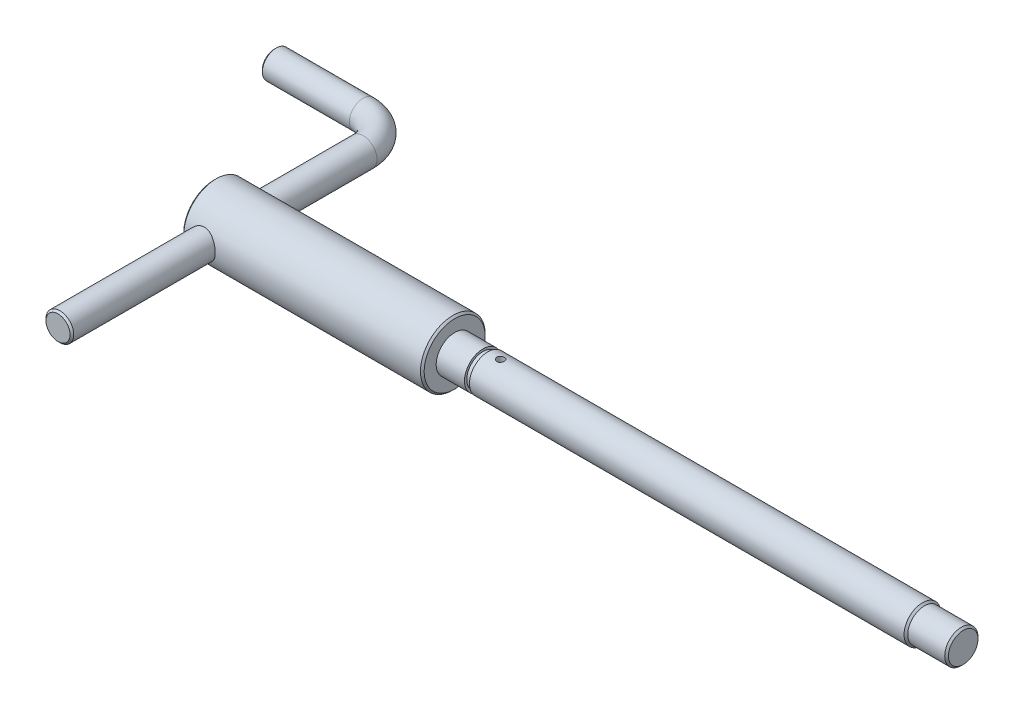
ISO-10303-21;
HEADER;
FILE_DESCRIPTION(('STEP AP214'),'2;1');
FILE_NAME('part.step','',(''),(''),'','','');
FILE_SCHEMA(('AUTOMOTIVE_DESIGN { 1 0 10303 214 1 1 1 1 }'));
ENDSEC;
DATA;
#1=APPLICATION_CONTEXT('core data for automotive mechanical design processes');
#2=APPLICATION_PROTOCOL_DEFINITION('international standard','automotive_design',2000,#1);
#3=PRODUCT_CONTEXT('',#1,'mechanical');
#4=PRODUCT('Part','Part','',(#3));
#5=PRODUCT_RELATED_PRODUCT_CATEGORY('part','',(#4));
#6=PRODUCT_DEFINITION_FORMATION('','',#4);
#7=PRODUCT_DEFINITION_CONTEXT('part definition',#1,'design');
#8=PRODUCT_DEFINITION('design','',#6,#7);
#9=PRODUCT_DEFINITION_SHAPE('','',#8);
#10=(LENGTH_UNIT() NAMED_UNIT(*) SI_UNIT(.MILLI.,.METRE.));
#11=(NAMED_UNIT(*) PLANE_ANGLE_UNIT() SI_UNIT($,.RADIAN.));
#12=(NAMED_UNIT(*) SI_UNIT($,.STERADIAN.) SOLID_ANGLE_UNIT());
#13=UNCERTAINTY_MEASURE_WITH_UNIT(LENGTH_MEASURE(1.E-05),#10,'distance_accuracy_value','');
#14=(GEOMETRIC_REPRESENTATION_CONTEXT(3) GLOBAL_UNCERTAINTY_ASSIGNED_CONTEXT((#13)) GLOBAL_UNIT_ASSIGNED_CONTEXT((#10,
#11,#12)) REPRESENTATION_CONTEXT('',''));
#15=CARTESIAN_POINT('',(0.,0.,0.));
#16=DIRECTION('',(0.,0.,1.));
#17=DIRECTION('',(1.,0.,0.));
#18=AXIS2_PLACEMENT_3D('',#15,#16,#17);
#19=CARTESIAN_POINT('',(0.,0.,0.));
#20=DIRECTION('',(-1.,0.,0.));
#21=DIRECTION('',(0.,0.,1.));
#22=AXIS2_PLACEMENT_3D('',#19,#20,#21);
#23=CYLINDRICAL_SURFACE('',#22,10.);
#24=CARTESIAN_POINT('',(383.,0.,0.));
#25=DIRECTION('',(1.,0.,0.));
#26=DIRECTION('',(0.,0.,-1.));
#27=AXIS2_PLACEMENT_3D('',#24,#25,#26);
#28=CIRCLE('',#27,10.);
#29=CARTESIAN_POINT('',(383.,0.,-10.));
#30=VERTEX_POINT('',#29);
#31=EDGE_CURVE('E74',#30,#30,#28,.F.);
#32=ORIENTED_EDGE('',*,*,#31,.T.);
#33=EDGE_LOOP('',(#32));
#34=FACE_BOUND('',#33,.T.);
#35=CARTESIAN_POINT('',(148.,0.,0.));
#36=DIRECTION('',(-1.,0.,0.));
#37=DIRECTION('',(0.,0.,1.));
#38=AXIS2_PLACEMENT_3D('',#35,#36,#37);
#39=CIRCLE('',#38,10.);
#40=CARTESIAN_POINT('',(148.,0.,10.));
#41=VERTEX_POINT('',#40);
#42=EDGE_CURVE('E153',#41,#41,#39,.T.);
#43=ORIENTED_EDGE('',*,*,#42,.F.);
#44=EDGE_LOOP('',(#43));
#45=FACE_BOUND('',#44,.T.);
#46=CARTESIAN_POINT('',(154.91,-9.79795897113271,-2.));
#47=CARTESIAN_POINT('',(154.798871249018,-9.79796118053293,-1.99999589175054));
#48=CARTESIAN_POINT('',(154.687690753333,-9.79987016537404,-1.99070634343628));
#49=CARTESIAN_POINT('',(154.468474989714,-9.80728862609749,-1.95382456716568));
#50=CARTESIAN_POINT('',(154.360442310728,-9.81280098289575,-1.92621769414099));
#51=CARTESIAN_POINT('',(154.150725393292,-9.82677747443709,-1.85359156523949));
#52=CARTESIAN_POINT('',(154.049034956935,-9.83523867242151,-1.80858962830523));
#53=CARTESIAN_POINT('',(153.854650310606,-9.85415598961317,-1.702498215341));
#54=CARTESIAN_POINT('',(153.761955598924,-9.86461199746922,-1.64140963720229));
#55=CARTESIAN_POINT('',(153.586877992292,-9.88650599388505,-1.50395815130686));
#56=CARTESIAN_POINT('',(153.504640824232,-9.89795475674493,-1.42741131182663));
#57=CARTESIAN_POINT('',(153.354084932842,-9.92044944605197,-1.26161357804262));
#58=CARTESIAN_POINT('',(153.285767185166,-9.93149534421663,-1.17236179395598));
#59=CARTESIAN_POINT('',(153.164423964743,-9.95205592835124,-0.982722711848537));
#60=CARTESIAN_POINT('',(153.111536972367,-9.96155642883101,-0.882245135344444));
#61=CARTESIAN_POINT('',(153.023450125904,-9.97783473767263,-0.673608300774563));
#62=CARTESIAN_POINT('',(152.988248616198,-9.98461280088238,-0.565449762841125));
#63=CARTESIAN_POINT('',(152.936985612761,-9.99460641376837,-0.346033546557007));
#64=CARTESIAN_POINT('',(152.920678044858,-9.99786772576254,-0.234835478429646));
#65=CARTESIAN_POINT('',(152.906898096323,-10.0006184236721,-0.0112371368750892));
#66=CARTESIAN_POINT('',(152.909423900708,-10.0001081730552,0.101163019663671));
#67=CARTESIAN_POINT('',(152.933052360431,-9.99540869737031,0.322284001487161));
#68=CARTESIAN_POINT('',(152.953889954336,-9.99127196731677,0.431034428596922));
#69=CARTESIAN_POINT('',(153.013130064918,-9.97984354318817,0.643463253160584));
#70=CARTESIAN_POINT('',(153.051533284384,-9.97255172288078,0.747141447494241));
#71=CARTESIAN_POINT('',(153.145060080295,-9.95554592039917,0.947238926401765));
#72=CARTESIAN_POINT('',(153.20028750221,-9.94581696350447,1.04360834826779));
#73=CARTESIAN_POINT('',(153.325818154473,-9.92500938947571,1.22581009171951));
#74=CARTESIAN_POINT('',(153.396123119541,-9.91393061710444,1.31164119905));
#75=CARTESIAN_POINT('',(153.551267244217,-9.89141928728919,1.47190286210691));
#76=CARTESIAN_POINT('',(153.636338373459,-9.87998392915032,1.54610863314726));
#77=CARTESIAN_POINT('',(153.817832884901,-9.85823143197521,1.67923698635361));
#78=CARTESIAN_POINT('',(153.914256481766,-9.84791431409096,1.7381592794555));
#79=CARTESIAN_POINT('',(154.116041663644,-9.82956094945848,1.83912562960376));
#80=CARTESIAN_POINT('',(154.221421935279,-9.82152963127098,1.88113329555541));
#81=CARTESIAN_POINT('',(154.437942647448,-9.80872952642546,1.94678068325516));
#82=CARTESIAN_POINT('',(154.549082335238,-9.80396031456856,1.97042279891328));
#83=CARTESIAN_POINT('',(154.771929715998,-9.79830958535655,1.9983320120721));
#84=CARTESIAN_POINT('',(154.883595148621,-9.79736294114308,2.00292371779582));
#85=CARTESIAN_POINT('',(155.106096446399,-9.79928971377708,1.99347525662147));
#86=CARTESIAN_POINT('',(155.216932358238,-9.80216291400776,1.97943614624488));
#87=CARTESIAN_POINT('',(155.433537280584,-9.81134464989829,1.93340441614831));
#88=CARTESIAN_POINT('',(155.539344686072,-9.81761998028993,1.90158524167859));
#89=CARTESIAN_POINT('',(155.744126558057,-9.83286978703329,1.82108207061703));
#90=CARTESIAN_POINT('',(155.843100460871,-9.84184448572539,1.77239668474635));
#91=CARTESIAN_POINT('',(156.0328262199,-9.86162811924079,1.6588082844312));
#92=CARTESIAN_POINT('',(156.123454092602,-9.87245943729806,1.59370215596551));
#93=CARTESIAN_POINT('',(156.292616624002,-9.89467447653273,1.44939114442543));
#94=CARTESIAN_POINT('',(156.371150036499,-9.90605825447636,1.37018481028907));
#95=CARTESIAN_POINT('',(156.515125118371,-9.92830691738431,1.19846454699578));
#96=CARTESIAN_POINT('',(156.5803473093,-9.93916115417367,1.10576499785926));
#97=CARTESIAN_POINT('',(156.694291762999,-9.9589425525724,0.910535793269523));
#98=CARTESIAN_POINT('',(156.74301471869,-9.96786979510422,0.808006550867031));
#99=CARTESIAN_POINT('',(156.822257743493,-9.98274588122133,0.596605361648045));
#100=CARTESIAN_POINT('',(156.852881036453,-9.98871158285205,0.487773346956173));
#101=CARTESIAN_POINT('',(156.895382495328,-9.99706471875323,0.266378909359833));
#102=CARTESIAN_POINT('',(156.907262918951,-9.99945258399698,0.15381693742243));
#103=CARTESIAN_POINT('',(156.911853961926,-10.0003708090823,-0.0697457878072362));
#104=CARTESIAN_POINT('',(156.904894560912,-9.99896757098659,-0.180739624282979));
#105=CARTESIAN_POINT('',(156.872732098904,-9.99260087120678,-0.399942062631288));
#106=CARTESIAN_POINT('',(156.847529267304,-9.98763745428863,-0.508150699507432));
#107=CARTESIAN_POINT('',(156.779742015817,-9.97470996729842,-0.718505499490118));
#108=CARTESIAN_POINT('',(156.737197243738,-9.9667527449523,-0.82066488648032));
#109=CARTESIAN_POINT('',(156.635975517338,-9.9486944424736,-1.01644244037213));
#110=CARTESIAN_POINT('',(156.577297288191,-9.93859319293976,-1.11005993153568));
#111=CARTESIAN_POINT('',(156.444361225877,-9.91715198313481,-1.28772778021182));
#112=CARTESIAN_POINT('',(156.369867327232,-9.90579466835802,-1.37159943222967));
#113=CARTESIAN_POINT('',(156.207899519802,-9.8832244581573,-1.52576523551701));
#114=CARTESIAN_POINT('',(156.12042254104,-9.87201159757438,-1.59605616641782));
#115=CARTESIAN_POINT('',(155.933841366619,-9.85086685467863,-1.72178443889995));
#116=CARTESIAN_POINT('',(155.834622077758,-9.84095007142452,-1.77705362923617));
#117=CARTESIAN_POINT('',(155.62813445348,-9.82370474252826,-1.87004809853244));
#118=CARTESIAN_POINT('',(155.520873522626,-9.81637385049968,-1.90778929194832));
#119=CARTESIAN_POINT('',(155.329475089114,-9.8065936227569,-1.95733827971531));
#120=CARTESIAN_POINT('',(155.246429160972,-9.80337569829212,-1.97330779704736));
#121=CARTESIAN_POINT('',(155.078932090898,-9.79905756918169,-1.99464003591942));
#122=CARTESIAN_POINT('',(154.994480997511,-9.79795729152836,-2.00000312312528));
#123=CARTESIAN_POINT('',(154.91,-9.79795897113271,-2.));
#124=B_SPLINE_CURVE_WITH_KNOTS('',3,(#46,#47,#48,#49,#50,#51,#52,#53,#54,#55,#56,#57,#58,#59,
#60,#61,#62,#63,#64,#65,#66,#67,#68,#69,#70,#71,#72,#73,#74,#75,#76,#77,#78,#79,#80,#81,#82,#83,
#84,#85,#86,#87,#88,#89,#90,#91,#92,#93,#94,#95,#96,#97,#98,#99,#100,#101,#102,#103,#104,#105,
#106,#107,#108,#109,#110,#111,#112,#113,#114,#115,#116,#117,#118,#119,#120,#121,#122,#123),
.UNSPECIFIED.,.T.,.F.,(4,2,2,2,2,2,2,2,2,2,2,2,2,2,2,2,2,2,2,2,2,2,2,2,2,2,2,2,2,2,2,2,2,2,2,2,
2,2,4),(0.,0.333076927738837,0.666420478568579,0.999432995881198,1.33242692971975,
1.66964505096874,2.0068868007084,2.34706800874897,2.68721736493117,3.02288497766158,
3.35852024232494,3.68937579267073,4.02024458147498,4.35319848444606,4.68619071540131,
5.02498693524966,5.36378956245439,5.7033172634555,6.04280070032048,6.37647515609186,
6.71013069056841,7.04058683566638,7.37107020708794,7.7058611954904,8.04068665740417,
8.380652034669,8.72060313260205,9.05859627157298,9.39654869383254,9.7286203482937,
10.0606878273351,10.392000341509,10.7233390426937,11.0600230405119,11.3967867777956,
11.7371779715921,12.0772595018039,12.3304760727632,12.5836839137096),.UNSPECIFIED.);
#125=CARTESIAN_POINT('',(154.91,-9.79795897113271,-2.));
#126=VERTEX_POINT('',#125);
#127=EDGE_CURVE('E104',#126,#126,#124,.T.);
#128=ORIENTED_EDGE('',*,*,#127,.T.);
#129=EDGE_LOOP('',(#128));
#130=FACE_BOUND('',#129,.T.);
#131=CARTESIAN_POINT('',(154.91,9.79795897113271,-2.));
#132=CARTESIAN_POINT('',(155.021128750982,9.79796118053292,-1.99999589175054));
#133=CARTESIAN_POINT('',(155.132309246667,9.79987016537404,-1.99070634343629));
#134=CARTESIAN_POINT('',(155.351525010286,9.80728862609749,-1.95382456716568));
#135=CARTESIAN_POINT('',(155.459557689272,9.81280098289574,-1.92621769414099));
#136=CARTESIAN_POINT('',(155.669274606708,9.82677747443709,-1.85359156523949));
#137=CARTESIAN_POINT('',(155.770965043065,9.83523867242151,-1.80858962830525));
#138=CARTESIAN_POINT('',(155.965349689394,9.85415598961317,-1.70249821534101));
#139=CARTESIAN_POINT('',(156.058044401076,9.86461199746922,-1.6414096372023));
#140=CARTESIAN_POINT('',(156.233122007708,9.88650599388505,-1.50395815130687));
#141=CARTESIAN_POINT('',(156.315359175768,9.89795475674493,-1.42741131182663));
#142=CARTESIAN_POINT('',(156.465915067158,9.92044944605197,-1.26161357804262));
#143=CARTESIAN_POINT('',(156.534232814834,9.93149534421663,-1.17236179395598));
#144=CARTESIAN_POINT('',(156.655576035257,9.95205592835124,-0.982722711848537));
#145=CARTESIAN_POINT('',(156.708463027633,9.96155642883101,-0.882245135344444));
#146=CARTESIAN_POINT('',(156.796549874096,9.97783473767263,-0.673608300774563));
#147=CARTESIAN_POINT('',(156.831751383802,9.98461280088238,-0.565449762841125));
#148=CARTESIAN_POINT('',(156.883014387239,9.99460641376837,-0.346033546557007));
#149=CARTESIAN_POINT('',(156.899321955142,9.99786772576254,-0.234835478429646));
#150=CARTESIAN_POINT('',(156.913101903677,10.0006184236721,-0.0112371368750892));
#151=CARTESIAN_POINT('',(156.910576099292,10.0001081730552,0.101163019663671));
#152=CARTESIAN_POINT('',(156.886947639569,9.99540869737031,0.322284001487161));
#153=CARTESIAN_POINT('',(156.866110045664,9.99127196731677,0.431034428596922));
#154=CARTESIAN_POINT('',(156.806869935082,9.97984354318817,0.643463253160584));
#155=CARTESIAN_POINT('',(156.768466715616,9.97255172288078,0.747141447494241));
#156=CARTESIAN_POINT('',(156.674939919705,9.95554592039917,0.947238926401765));
#157=CARTESIAN_POINT('',(156.61971249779,9.94581696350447,1.04360834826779));
#158=CARTESIAN_POINT('',(156.494181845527,9.92500938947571,1.22581009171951));
#159=CARTESIAN_POINT('',(156.423876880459,9.91393061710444,1.31164119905));
#160=CARTESIAN_POINT('',(156.268732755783,9.89141928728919,1.47190286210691));
#161=CARTESIAN_POINT('',(156.183661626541,9.87998392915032,1.54610863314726));
#162=CARTESIAN_POINT('',(156.002167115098,9.85823143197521,1.67923698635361));
#163=CARTESIAN_POINT('',(155.905743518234,9.84791431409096,1.7381592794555));
#164=CARTESIAN_POINT('',(155.703958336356,9.82956094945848,1.83912562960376));
#165=CARTESIAN_POINT('',(155.598578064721,9.82152963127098,1.88113329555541));
#166=CARTESIAN_POINT('',(155.382057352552,9.80872952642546,1.94678068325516));
#167=CARTESIAN_POINT('',(155.270917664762,9.80396031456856,1.97042279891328));
#168=CARTESIAN_POINT('',(155.048070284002,9.79830958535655,1.9983320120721));
#169=CARTESIAN_POINT('',(154.936404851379,9.79736294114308,2.00292371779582));
#170=CARTESIAN_POINT('',(154.713903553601,9.79928971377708,1.99347525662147));
#171=CARTESIAN_POINT('',(154.603067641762,9.80216291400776,1.97943614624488));
#172=CARTESIAN_POINT('',(154.386462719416,9.81134464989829,1.93340441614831));
#173=CARTESIAN_POINT('',(154.280655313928,9.81761998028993,1.90158524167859));
#174=CARTESIAN_POINT('',(154.075873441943,9.83286978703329,1.82108207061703));
#175=CARTESIAN_POINT('',(153.976899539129,9.84184448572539,1.77239668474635));
#176=CARTESIAN_POINT('',(153.7871737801,9.86162811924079,1.6588082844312));
#177=CARTESIAN_POINT('',(153.696545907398,9.87245943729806,1.59370215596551));
#178=CARTESIAN_POINT('',(153.527383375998,9.89467447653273,1.44939114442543));
#179=CARTESIAN_POINT('',(153.448849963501,9.90605825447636,1.37018481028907));
#180=CARTESIAN_POINT('',(153.304874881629,9.92830691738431,1.19846454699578));
#181=CARTESIAN_POINT('',(153.2396526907,9.93916115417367,1.10576499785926));
#182=CARTESIAN_POINT('',(153.125708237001,9.9589425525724,0.910535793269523));
#183=CARTESIAN_POINT('',(153.07698528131,9.96786979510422,0.808006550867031));
#184=CARTESIAN_POINT('',(152.997742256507,9.98274588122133,0.596605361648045));
#185=CARTESIAN_POINT('',(152.967118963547,9.98871158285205,0.487773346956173));
#186=CARTESIAN_POINT('',(152.924617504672,9.99706471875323,0.266378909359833));
#187=CARTESIAN_POINT('',(152.912737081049,9.99945258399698,0.15381693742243));
#188=CARTESIAN_POINT('',(152.908146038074,10.0003708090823,-0.0697457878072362));
#189=CARTESIAN_POINT('',(152.915105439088,9.99896757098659,-0.180739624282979));
#190=CARTESIAN_POINT('',(152.947267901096,9.99260087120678,-0.399942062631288));
#191=CARTESIAN_POINT('',(152.972470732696,9.98763745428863,-0.508150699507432));
#192=CARTESIAN_POINT('',(153.040257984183,9.97470996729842,-0.718505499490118));
#193=CARTESIAN_POINT('',(153.082802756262,9.9667527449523,-0.82066488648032));
#194=CARTESIAN_POINT('',(153.184024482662,9.9486944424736,-1.01644244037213));
#195=CARTESIAN_POINT('',(153.242702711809,9.93859319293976,-1.11005993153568));
#196=CARTESIAN_POINT('',(153.375638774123,9.91715198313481,-1.28772778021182));
#197=CARTESIAN_POINT('',(153.450132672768,9.90579466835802,-1.37159943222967));
#198=CARTESIAN_POINT('',(153.612100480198,9.8832244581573,-1.52576523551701));
#199=CARTESIAN_POINT('',(153.69957745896,9.87201159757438,-1.59605616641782));
#200=CARTESIAN_POINT('',(153.886158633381,9.85086685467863,-1.72178443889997));
#201=CARTESIAN_POINT('',(153.985377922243,9.84095007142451,-1.77705362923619));
#202=CARTESIAN_POINT('',(154.19186554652,9.82370474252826,-1.87004809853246));
#203=CARTESIAN_POINT('',(154.299126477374,9.81637385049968,-1.90778929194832));
#204=CARTESIAN_POINT('',(154.490524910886,9.8065936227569,-1.95733827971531));
#205=CARTESIAN_POINT('',(154.573570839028,9.80337569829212,-1.97330779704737));
#206=CARTESIAN_POINT('',(154.741067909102,9.79905756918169,-1.99464003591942));
#207=CARTESIAN_POINT('',(154.825519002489,9.79795729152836,-2.00000312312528));
#208=CARTESIAN_POINT('',(154.91,9.79795897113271,-2.));
#209=B_SPLINE_CURVE_WITH_KNOTS('',3,(#131,#132,#133,#134,#135,#136,#137,#138,#139,#140,#141,
#142,#143,#144,#145,#146,#147,#148,#149,#150,#151,#152,#153,#154,#155,#156,#157,#158,#159,#160,
#161,#162,#163,#164,#165,#166,#167,#168,#169,#170,#171,#172,#173,#174,#175,#176,#177,#178,#179,
#180,#181,#182,#183,#184,#185,#186,#187,#188,#189,#190,#191,#192,#193,#194,#195,#196,#197,#198,
#199,#200,#201,#202,#203,#204,#205,#206,#207,#208),.UNSPECIFIED.,.T.,.F.,(4,2,2,2,2,2,2,2,2,2,2,
2,2,2,2,2,2,2,2,2,2,2,2,2,2,2,2,2,2,2,2,2,2,2,2,2,2,2,4),(0.,0.333076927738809,
0.666420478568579,0.999432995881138,1.33242692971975,1.66964505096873,2.0068868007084,
2.34706800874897,2.68721736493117,3.02288497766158,3.35852024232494,3.68937579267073,
4.02024458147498,4.35319848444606,4.68619071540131,5.02498693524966,5.36378956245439,
5.7033172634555,6.04280070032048,6.37647515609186,6.71013069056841,7.04058683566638,
7.37107020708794,7.7058611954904,8.04068665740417,8.380652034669,8.72060313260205,
9.05859627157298,9.39654869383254,9.7286203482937,10.0606878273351,10.392000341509,
10.7233390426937,11.0600230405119,11.3967867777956,11.7371779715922,12.0772595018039,
12.3304760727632,12.5836839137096),.UNSPECIFIED.);
#210=CARTESIAN_POINT('',(154.91,9.79795897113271,-2.));
#211=VERTEX_POINT('',#210);
#212=EDGE_CURVE('E147',#211,#211,#209,.T.);
#213=ORIENTED_EDGE('',*,*,#212,.T.);
#214=EDGE_LOOP('',(#213));
#215=FACE_BOUND('',#214,.T.);
#216=ADVANCED_FACE('F42',(#34,#45,#130,#215),#23,.T.);
#217=CARTESIAN_POINT('',(0.,0.,0.));
#218=DIRECTION('',(1.,0.,0.));
#219=DIRECTION('',(0.,0.,-1.));
#220=AXIS2_PLACEMENT_3D('',#217,#218,#219);
#221=PLANE('',#220);
#222=CARTESIAN_POINT('',(0.,0.,0.));
#223=DIRECTION('',(1.,0.,0.));
#224=DIRECTION('',(0.,0.,-1.));
#225=AXIS2_PLACEMENT_3D('',#222,#223,#224);
#226=CIRCLE('',#225,16.5000000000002);
#227=CARTESIAN_POINT('',(0.,0.,-16.5000000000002));
#228=VERTEX_POINT('',#227);
#229=EDGE_CURVE('E60',#228,#228,#226,.F.);
#230=ORIENTED_EDGE('',*,*,#229,.T.);
#231=EDGE_LOOP('',(#230));
#232=FACE_BOUND('',#231,.T.);
#233=ADVANCED_FACE('F157',(#232),#221,.F.);
#234=CARTESIAN_POINT('',(0.,0.,0.));
#235=DIRECTION('',(-1.,0.,0.));
#236=DIRECTION('',(0.,0.,1.));
#237=AXIS2_PLACEMENT_3D('',#234,#235,#236);
#238=CYLINDRICAL_SURFACE('',#237,17.5);
#239=CARTESIAN_POINT('',(0.999999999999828,0.,0.));
#240=DIRECTION('',(1.,0.,0.));
#241=DIRECTION('',(0.,0.,-1.));
#242=AXIS2_PLACEMENT_3D('',#239,#240,#241);
#243=CIRCLE('',#242,17.5);
#244=CARTESIAN_POINT('',(0.999999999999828,0.,-17.5));
#245=VERTEX_POINT('',#244);
#246=EDGE_CURVE('E50',#245,#245,#243,.T.);
#247=ORIENTED_EDGE('',*,*,#246,.T.);
#248=EDGE_LOOP('',(#247));
#249=FACE_BOUND('',#248,.T.);
#250=CARTESIAN_POINT('',(129.,0.,0.));
#251=DIRECTION('',(-1.,0.,0.));
#252=DIRECTION('',(0.,0.,1.));
#253=AXIS2_PLACEMENT_3D('',#250,#251,#252);
#254=CIRCLE('',#253,17.5);
#255=CARTESIAN_POINT('',(129.,0.,17.5));
#256=VERTEX_POINT('',#255);
#257=EDGE_CURVE('E55',#256,#256,#254,.T.);
#258=ORIENTED_EDGE('',*,*,#257,.T.);
#259=EDGE_LOOP('',(#258));
#260=FACE_BOUND('',#259,.T.);
#261=CARTESIAN_POINT('',(18.,0.,17.5));
#262=CARTESIAN_POINT('',(17.9999985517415,-0.200454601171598,17.4999988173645));
#263=CARTESIAN_POINT('',(17.9919528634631,-0.400969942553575,17.4965465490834));
#264=CARTESIAN_POINT('',(17.9598467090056,-0.800566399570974,17.4828232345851));
#265=CARTESIAN_POINT('',(17.9357765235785,-0.999646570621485,17.4725480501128));
#266=CARTESIAN_POINT('',(17.8718124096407,-1.39520418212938,17.4454228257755));
#267=CARTESIAN_POINT('',(17.8318872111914,-1.59167568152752,17.4285597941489));
#268=CARTESIAN_POINT('',(17.736610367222,-1.98028152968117,17.3886934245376));
#269=CARTESIAN_POINT('',(17.6812524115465,-2.17241406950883,17.3656875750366));
#270=CARTESIAN_POINT('',(17.5559021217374,-2.5502368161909,17.3142283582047));
#271=CARTESIAN_POINT('',(17.4859678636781,-2.73594927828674,17.2857966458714));
#272=CARTESIAN_POINT('',(17.3319246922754,-3.1006460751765,17.2241172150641));
#273=CARTESIAN_POINT('',(17.2478104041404,-3.27962782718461,17.1908676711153));
#274=CARTESIAN_POINT('',(17.0661613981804,-3.62965251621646,17.1203818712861));
#275=CARTESIAN_POINT('',(16.9686361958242,-3.8007009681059,17.0831484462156));
#276=CARTESIAN_POINT('',(16.7607792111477,-4.1341577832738,17.0055302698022));
#277=CARTESIAN_POINT('',(16.650442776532,-4.29656297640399,16.9651443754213));
#278=CARTESIAN_POINT('',(16.4121235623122,-4.61941038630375,16.8801725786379));
#279=CARTESIAN_POINT('',(16.2835493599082,-4.77938763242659,16.8354781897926));
#280=CARTESIAN_POINT('',(16.0139383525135,-5.08807259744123,16.7447723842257));
#281=CARTESIAN_POINT('',(15.8729010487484,-5.23677986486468,16.6987609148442));
#282=CARTESIAN_POINT('',(15.5790615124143,-5.5222386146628,16.6065467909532));
#283=CARTESIAN_POINT('',(15.4262511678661,-5.65898171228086,16.5603440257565));
#284=CARTESIAN_POINT('',(15.1098167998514,-5.9195936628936,16.4689852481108));
#285=CARTESIAN_POINT('',(14.946196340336,-6.04346672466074,16.4238288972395));
#286=CARTESIAN_POINT('',(14.5999430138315,-6.28388584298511,16.3334057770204));
#287=CARTESIAN_POINT('',(14.4167616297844,-6.39968967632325,16.2882613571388));
#288=CARTESIAN_POINT('',(14.040435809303,-6.61530960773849,16.2018878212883));
#289=CARTESIAN_POINT('',(13.8472955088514,-6.71513227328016,16.1606570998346));
#290=CARTESIAN_POINT('',(13.4522284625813,-6.89794958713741,16.0834741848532));
#291=CARTESIAN_POINT('',(13.2503034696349,-6.9809475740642,16.047520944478));
#292=CARTESIAN_POINT('',(12.8390377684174,-7.12928296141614,15.9821745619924));
#293=CARTESIAN_POINT('',(12.6296976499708,-7.19462176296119,15.9527808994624));
#294=CARTESIAN_POINT('',(12.2158464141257,-7.30406478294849,15.9029579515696));
#295=CARTESIAN_POINT('',(12.0116184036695,-7.34906848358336,15.882153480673));
#296=CARTESIAN_POINT('',(11.5994891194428,-7.42192056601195,15.8482401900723));
#297=CARTESIAN_POINT('',(11.3915879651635,-7.4497695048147,15.8351311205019));
#298=CARTESIAN_POINT('',(10.9739350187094,-7.48794608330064,15.8171145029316));
#299=CARTESIAN_POINT('',(10.7641842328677,-7.49828272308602,15.8122027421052));
#300=CARTESIAN_POINT('',(10.3445319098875,-7.50132329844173,15.810760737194));
#301=CARTESIAN_POINT('',(10.1346303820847,-7.49402824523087,15.8142300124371));
#302=CARTESIAN_POINT('',(9.73370675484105,-7.46323203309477,15.8287845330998));
#303=CARTESIAN_POINT('',(9.54255272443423,-7.44111418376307,15.8392194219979));
#304=CARTESIAN_POINT('',(9.16290660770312,-7.38234975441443,15.8666935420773));
#305=CARTESIAN_POINT('',(8.97441545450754,-7.34569820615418,15.8837350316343));
#306=CARTESIAN_POINT('',(8.60145754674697,-7.25825174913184,15.923884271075));
#307=CARTESIAN_POINT('',(8.41698989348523,-7.2074600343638,15.9469906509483));
#308=CARTESIAN_POINT('',(8.05308824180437,-7.0921835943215,15.9985910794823));
#309=CARTESIAN_POINT('',(7.87365621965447,-7.02769357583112,16.0270872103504));
#310=CARTESIAN_POINT('',(7.51711569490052,-6.88404883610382,16.0893170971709));
#311=CARTESIAN_POINT('',(7.34013924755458,-6.80460963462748,16.1231499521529));
#312=CARTESIAN_POINT('',(6.99343000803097,-6.63260366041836,16.194667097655));
#313=CARTESIAN_POINT('',(6.82369968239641,-6.5400324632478,16.2323526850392));
#314=CARTESIAN_POINT('',(6.49234298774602,-6.34238965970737,16.3105912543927));
#315=CARTESIAN_POINT('',(6.33071787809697,-6.2373161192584,16.3511446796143));
#316=CARTESIAN_POINT('',(6.01633918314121,-6.01529905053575,16.4341175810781));
#317=CARTESIAN_POINT('',(5.86358612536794,-5.89835481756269,16.4765371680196));
#318=CARTESIAN_POINT('',(5.55430244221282,-5.64215816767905,16.5661124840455));
#319=CARTESIAN_POINT('',(5.39867272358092,-5.50184507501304,16.6133504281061));
#320=CARTESIAN_POINT('',(5.09970028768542,-5.2087025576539,16.7075764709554));
#321=CARTESIAN_POINT('',(4.95635409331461,-5.05587669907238,16.7545646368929));
#322=CARTESIAN_POINT('',(4.68265988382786,-4.73840717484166,16.8471020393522));
#323=CARTESIAN_POINT('',(4.55232017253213,-4.57375607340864,16.8926503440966));
#324=CARTESIAN_POINT('',(4.30565329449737,-4.23369484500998,16.9810682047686));
#325=CARTESIAN_POINT('',(4.18932053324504,-4.05828905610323,17.0239388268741));
#326=CARTESIAN_POINT('',(3.96860624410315,-3.69291637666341,17.1069685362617));
#327=CARTESIAN_POINT('',(3.86461866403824,-3.50268810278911,17.1470268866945));
#328=CARTESIAN_POINT('',(3.67320928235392,-3.11319608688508,17.2220009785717));
#329=CARTESIAN_POINT('',(3.58578027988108,-2.9139363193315,17.2569189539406));
#330=CARTESIAN_POINT('',(3.42832320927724,-2.50775149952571,17.3206070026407));
#331=CARTESIAN_POINT('',(3.35829094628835,-2.30082830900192,17.349378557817));
#332=CARTESIAN_POINT('',(3.2363833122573,-1.88086874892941,17.3999151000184));
#333=CARTESIAN_POINT('',(3.18450647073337,-1.66783287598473,17.4216806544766));
#334=CARTESIAN_POINT('',(3.10234352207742,-1.2516579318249,17.4563464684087));
#335=CARTESIAN_POINT('',(3.0708562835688,-1.04879628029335,17.4697378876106));
#336=CARTESIAN_POINT('',(3.02460933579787,-0.640835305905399,17.4894546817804));
#337=CARTESIAN_POINT('',(3.00984889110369,-0.435736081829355,17.4957803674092));
#338=CARTESIAN_POINT('',(2.9972280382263,-0.0249783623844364,17.5011872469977));
#339=CARTESIAN_POINT('',(2.99936313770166,0.180679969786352,17.500270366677));
#340=CARTESIAN_POINT('',(3.02049787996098,0.590965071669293,17.4912223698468));
#341=CARTESIAN_POINT('',(3.0394971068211,0.795591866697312,17.4830914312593));
#342=CARTESIAN_POINT('',(3.09267624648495,1.19132790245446,17.4604668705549));
#343=CARTESIAN_POINT('',(3.12599064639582,1.38257514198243,17.4463364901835));
#344=CARTESIAN_POINT('',(3.20721172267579,1.76147435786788,17.4121625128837));
#345=CARTESIAN_POINT('',(3.25512346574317,1.9491250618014,17.3921168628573));
#346=CARTESIAN_POINT('',(3.3650695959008,2.31949912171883,17.3466057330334));
#347=CARTESIAN_POINT('',(3.42709979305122,2.50222392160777,17.3211418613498));
#348=CARTESIAN_POINT('',(3.56477871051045,2.86177944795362,17.2653796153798));
#349=CARTESIAN_POINT('',(3.64043262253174,3.03860789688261,17.2350793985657));
#350=CARTESIAN_POINT('',(3.80728294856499,3.39067058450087,17.1693448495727));
#351=CARTESIAN_POINT('',(3.89888673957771,3.56568747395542,17.1337809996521));
#352=CARTESIAN_POINT('',(4.09525842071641,3.90744706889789,17.0590875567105));
#353=CARTESIAN_POINT('',(4.2000308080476,4.07418692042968,17.0199567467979));
#354=CARTESIAN_POINT('',(4.42203285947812,4.39851584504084,16.939037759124));
#355=CARTESIAN_POINT('',(4.53926480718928,4.55610323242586,16.8972490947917));
#356=CARTESIAN_POINT('',(4.78546986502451,4.86133694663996,16.8119754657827));
#357=CARTESIAN_POINT('',(4.91444358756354,5.00898275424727,16.7684904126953));
#358=CARTESIAN_POINT('',(5.1936111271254,5.30439432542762,16.6775015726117));
#359=CARTESIAN_POINT('',(5.34467208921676,5.45132482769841,16.6299425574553));
#360=CARTESIAN_POINT('',(5.65864760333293,5.73198339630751,16.5353045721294));
#361=CARTESIAN_POINT('',(5.82155859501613,5.86571539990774,16.4882254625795));
#362=CARTESIAN_POINT('',(6.15849788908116,6.11930103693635,16.3958038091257));
#363=CARTESIAN_POINT('',(6.3325336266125,6.23914523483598,16.3504624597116));
#364=CARTESIAN_POINT('',(6.69059108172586,6.46398274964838,16.2628866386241));
#365=CARTESIAN_POINT('',(6.87460859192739,6.56898225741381,16.22065087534));
#366=CARTESIAN_POINT('',(7.25513605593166,6.76516963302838,16.1398249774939));
#367=CARTESIAN_POINT('',(7.45181426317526,6.85606566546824,16.1013168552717));
#368=CARTESIAN_POINT('',(7.85313438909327,7.02076358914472,16.0301880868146));
#369=CARTESIAN_POINT('',(8.05777256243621,7.09457340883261,15.9975647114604));
#370=CARTESIAN_POINT('',(8.4735172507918,7.22431723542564,15.9393946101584));
#371=CARTESIAN_POINT('',(8.68462047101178,7.28026018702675,15.9138443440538));
#372=CARTESIAN_POINT('',(9.11168643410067,7.37362498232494,15.870800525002));
#373=CARTESIAN_POINT('',(9.32764867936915,7.41104871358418,15.8533061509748));
#374=CARTESIAN_POINT('',(9.74503421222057,7.46462802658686,15.8281434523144));
#375=CARTESIAN_POINT('',(9.94622921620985,7.4822525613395,15.8197977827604));
#376=CARTESIAN_POINT('',(10.3495534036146,7.50120758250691,15.8108190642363));
#377=CARTESIAN_POINT('',(10.551682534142,7.50253898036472,15.8101855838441));
#378=CARTESIAN_POINT('',(10.9552294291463,7.48889324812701,15.8166536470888));
#379=CARTESIAN_POINT('',(11.1566473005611,7.4739186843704,15.8237539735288));
#380=CARTESIAN_POINT('',(11.5572188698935,7.42784841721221,15.8454319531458));
#381=CARTESIAN_POINT('',(11.7563725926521,7.39675289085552,15.8600095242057));
#382=CARTESIAN_POINT('',(12.1405737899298,7.32084921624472,15.8951820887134));
#383=CARTESIAN_POINT('',(12.3258136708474,7.27684482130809,15.915421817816));
#384=CARTESIAN_POINT('',(12.6918238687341,7.17509583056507,15.9615512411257));
#385=CARTESIAN_POINT('',(12.8725926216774,7.11734649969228,15.987442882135));
#386=CARTESIAN_POINT('',(13.2285278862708,6.98862987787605,16.0441263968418));
#387=CARTESIAN_POINT('',(13.4036952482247,6.9176646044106,16.0749175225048));
#388=CARTESIAN_POINT('',(13.747608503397,6.76303209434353,16.1405839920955));
#389=CARTESIAN_POINT('',(13.9163519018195,6.67935998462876,16.1754609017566));
#390=CARTESIAN_POINT('',(14.2567215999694,6.49436957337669,16.2506533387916));
#391=CARTESIAN_POINT('',(14.4278849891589,6.39228168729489,16.2911715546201));
#392=CARTESIAN_POINT('',(14.7611819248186,6.17510400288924,16.3747252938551));
#393=CARTESIAN_POINT('',(14.9233123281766,6.06000972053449,16.4177616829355));
#394=CARTESIAN_POINT('',(15.2377210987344,5.81750965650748,16.5052474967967));
#395=CARTESIAN_POINT('',(15.3899979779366,5.69010202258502,16.54969713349));
#396=CARTESIAN_POINT('',(15.6839327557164,5.42366959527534,16.6389165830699));
#397=CARTESIAN_POINT('',(15.825590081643,5.2846441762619,16.6836864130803));
#398=CARTESIAN_POINT('',(16.1083325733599,4.98422049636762,16.7759991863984));
#399=CARTESIAN_POINT('',(16.248483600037,4.82192235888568,16.8234808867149));
#400=CARTESIAN_POINT('',(16.5146012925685,4.48559255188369,16.9162607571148));
#401=CARTESIAN_POINT('',(16.6405726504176,4.31156479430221,16.9615596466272));
#402=CARTESIAN_POINT('',(16.8775769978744,3.95257033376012,17.048792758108));
#403=CARTESIAN_POINT('',(16.9885961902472,3.76759375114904,17.0907238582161));
#404=CARTESIAN_POINT('',(17.1945904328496,3.38807466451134,17.1699884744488));
#405=CARTESIAN_POINT('',(17.2895728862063,3.1935366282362,17.2073241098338));
#406=CARTESIAN_POINT('',(17.4614469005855,2.79891396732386,17.2758680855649));
#407=CARTESIAN_POINT('',(17.5385739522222,2.59894571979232,17.3071551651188));
#408=CARTESIAN_POINT('',(17.6756048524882,2.19241326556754,17.3633348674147));
#409=CARTESIAN_POINT('',(17.7355169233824,1.98585226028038,17.388230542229));
#410=CARTESIAN_POINT('',(17.8373668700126,1.56816774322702,17.4308582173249));
#411=CARTESIAN_POINT('',(17.8793485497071,1.35705668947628,17.4486076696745));
#412=CARTESIAN_POINT('',(17.9450221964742,0.931618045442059,17.4764831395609));
#413=CARTESIAN_POINT('',(17.9687272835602,0.717292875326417,17.4866146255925));
#414=CARTESIAN_POINT('',(17.9887709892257,0.418732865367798,17.4951900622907));
#415=CARTESIAN_POINT('',(17.9929805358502,0.33505589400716,17.4969926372));
#416=CARTESIAN_POINT('',(17.9985953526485,0.167589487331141,17.499397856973));
#417=CARTESIAN_POINT('',(18.0000006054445,0.0838000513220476,17.5000004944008));
#418=CARTESIAN_POINT('',(18.,0.,17.5));
#419=B_SPLINE_CURVE_WITH_KNOTS('',3,(#261,#262,#263,#264,#265,#266,#267,#268,#269,#270,#271,
#272,#273,#274,#275,#276,#277,#278,#279,#280,#281,#282,#283,#284,#285,#286,#287,#288,#289,#290,
#291,#292,#293,#294,#295,#296,#297,#298,#299,#300,#301,#302,#303,#304,#305,#306,#307,#308,#309,
#310,#311,#312,#313,#314,#315,#316,#317,#318,#319,#320,#321,#322,#323,#324,#325,#326,#327,#328,
#329,#330,#331,#332,#333,#334,#335,#336,#337,#338,#339,#340,#341,#342,#343,#344,#345,#346,#347,
#348,#349,#350,#351,#352,#353,#354,#355,#356,#357,#358,#359,#360,#361,#362,#363,#364,#365,#366,
#367,#368,#369,#370,#371,#372,#373,#374,#375,#376,#377,#378,#379,#380,#381,#382,#383,#384,#385,
#386,#387,#388,#389,#390,#391,#392,#393,#394,#395,#396,#397,#398,#399,#400,#401,#402,#403,#404,
#405,#406,#407,#408,#409,#410,#411,#412,#413,#414,#415,#416,#417,#418),.UNSPECIFIED.,.T.,.F.,(4,
2,2,2,2,2,2,2,2,2,2,2,2,2,2,2,2,2,2,2,2,2,2,2,2,2,2,2,2,2,2,2,2,2,2,2,2,2,2,2,2,2,2,2,2,2,2,2,2,
2,2,2,2,2,2,2,2,2,2,2,2,2,2,2,2,2,2,2,2,2,2,2,2,2,2,2,2,2,4),(0.,0.601279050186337,
1.20292312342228,1.80575972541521,2.40884317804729,3.00956820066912,3.61052143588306,
4.21105045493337,4.81179823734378,5.44126418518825,6.07075533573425,6.70068417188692,
7.33040635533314,7.99368610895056,8.65669258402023,9.31956736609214,9.98238953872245,
10.612020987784,11.2416319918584,11.8709193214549,12.5001705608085,13.0776295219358,
13.6552860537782,14.2328122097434,14.8105619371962,15.4006847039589,15.9910067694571,
16.5814202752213,17.171868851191,17.8155470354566,18.4590424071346,19.1029460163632,
19.7465915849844,20.4071352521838,21.0673910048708,21.7274873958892,22.3875303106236,
23.0039155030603,23.6202735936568,24.2364678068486,24.8526468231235,25.4358972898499,
26.0193504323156,26.6026306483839,27.1861336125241,27.787631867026,28.3893361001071,
28.9911508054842,29.5929969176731,30.2403556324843,30.887520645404,31.5351228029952,
32.1824540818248,32.8417750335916,33.5007894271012,34.1594733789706,34.8180901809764,
35.4237150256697,36.0293059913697,36.634801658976,37.2402906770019,37.8140580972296,
38.3880234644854,38.961901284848,39.5359997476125,40.1454687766,40.7551485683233,
41.3649202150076,41.9747247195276,42.6328325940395,43.2907220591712,43.9492144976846,
44.6074021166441,45.2563394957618,45.9049664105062,46.5519995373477,47.1985677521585,
47.4499309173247,47.7012956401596),.UNSPECIFIED.);
#420=CARTESIAN_POINT('',(18.,0.,17.5));
#421=VERTEX_POINT('',#420);
#422=EDGE_CURVE('E95',#421,#421,#419,.T.);
#423=ORIENTED_EDGE('',*,*,#422,.T.);
#424=EDGE_LOOP('',(#423));
#425=FACE_BOUND('',#424,.T.);
#426=CARTESIAN_POINT('',(18.,0.,-17.5));
#427=CARTESIAN_POINT('',(17.9999985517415,0.200454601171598,-17.4999988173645));
#428=CARTESIAN_POINT('',(17.9919528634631,0.400969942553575,-17.4965465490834));
#429=CARTESIAN_POINT('',(17.9598467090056,0.800566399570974,-17.4828232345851));
#430=CARTESIAN_POINT('',(17.9357765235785,0.999646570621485,-17.4725480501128));
#431=CARTESIAN_POINT('',(17.8718124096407,1.39520418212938,-17.4454228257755));
#432=CARTESIAN_POINT('',(17.8318872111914,1.59167568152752,-17.4285597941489));
#433=CARTESIAN_POINT('',(17.736610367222,1.98028152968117,-17.3886934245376));
#434=CARTESIAN_POINT('',(17.6812524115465,2.17241406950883,-17.3656875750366));
#435=CARTESIAN_POINT('',(17.5559021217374,2.5502368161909,-17.3142283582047));
#436=CARTESIAN_POINT('',(17.4859678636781,2.73594927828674,-17.2857966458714));
#437=CARTESIAN_POINT('',(17.3319246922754,3.1006460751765,-17.2241172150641));
#438=CARTESIAN_POINT('',(17.2478104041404,3.27962782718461,-17.1908676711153));
#439=CARTESIAN_POINT('',(17.0661613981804,3.62965251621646,-17.1203818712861));
#440=CARTESIAN_POINT('',(16.9686361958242,3.8007009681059,-17.0831484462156));
#441=CARTESIAN_POINT('',(16.7607792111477,4.1341577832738,-17.0055302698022));
#442=CARTESIAN_POINT('',(16.650442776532,4.29656297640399,-16.9651443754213));
#443=CARTESIAN_POINT('',(16.4121235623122,4.61941038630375,-16.8801725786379));
#444=CARTESIAN_POINT('',(16.2835493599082,4.77938763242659,-16.8354781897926));
#445=CARTESIAN_POINT('',(16.0139383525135,5.08807259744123,-16.7447723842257));
#446=CARTESIAN_POINT('',(15.8729010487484,5.23677986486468,-16.6987609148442));
#447=CARTESIAN_POINT('',(15.5790615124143,5.5222386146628,-16.6065467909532));
#448=CARTESIAN_POINT('',(15.4262511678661,5.65898171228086,-16.5603440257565));
#449=CARTESIAN_POINT('',(15.1098167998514,5.9195936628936,-16.4689852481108));
#450=CARTESIAN_POINT('',(14.946196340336,6.04346672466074,-16.4238288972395));
#451=CARTESIAN_POINT('',(14.5999430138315,6.28388584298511,-16.3334057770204));
#452=CARTESIAN_POINT('',(14.4167616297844,6.39968967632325,-16.2882613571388));
#453=CARTESIAN_POINT('',(14.040435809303,6.61530960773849,-16.2018878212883));
#454=CARTESIAN_POINT('',(13.8472955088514,6.71513227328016,-16.1606570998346));
#455=CARTESIAN_POINT('',(13.4522284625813,6.89794958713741,-16.0834741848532));
#456=CARTESIAN_POINT('',(13.2503034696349,6.9809475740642,-16.047520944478));
#457=CARTESIAN_POINT('',(12.8390377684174,7.12928296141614,-15.9821745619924));
#458=CARTESIAN_POINT('',(12.6296976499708,7.19462176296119,-15.9527808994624));
#459=CARTESIAN_POINT('',(12.2158464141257,7.30406478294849,-15.9029579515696));
#460=CARTESIAN_POINT('',(12.0116184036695,7.34906848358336,-15.882153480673));
#461=CARTESIAN_POINT('',(11.5994891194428,7.42192056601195,-15.8482401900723));
#462=CARTESIAN_POINT('',(11.3915879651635,7.4497695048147,-15.8351311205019));
#463=CARTESIAN_POINT('',(10.9739350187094,7.48794608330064,-15.8171145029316));
#464=CARTESIAN_POINT('',(10.7641842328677,7.49828272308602,-15.8122027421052));
#465=CARTESIAN_POINT('',(10.3445319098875,7.50132329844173,-15.810760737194));
#466=CARTESIAN_POINT('',(10.1346303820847,7.49402824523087,-15.8142300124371));
#467=CARTESIAN_POINT('',(9.73370675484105,7.46323203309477,-15.8287845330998));
#468=CARTESIAN_POINT('',(9.54255272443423,7.44111418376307,-15.8392194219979));
#469=CARTESIAN_POINT('',(9.16290660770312,7.38234975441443,-15.8666935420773));
#470=CARTESIAN_POINT('',(8.97441545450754,7.34569820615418,-15.8837350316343));
#471=CARTESIAN_POINT('',(8.60145754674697,7.25825174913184,-15.923884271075));
#472=CARTESIAN_POINT('',(8.41698989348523,7.2074600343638,-15.9469906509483));
#473=CARTESIAN_POINT('',(8.05308824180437,7.0921835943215,-15.9985910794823));
#474=CARTESIAN_POINT('',(7.87365621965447,7.02769357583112,-16.0270872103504));
#475=CARTESIAN_POINT('',(7.51711569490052,6.88404883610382,-16.0893170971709));
#476=CARTESIAN_POINT('',(7.34013924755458,6.80460963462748,-16.1231499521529));
#477=CARTESIAN_POINT('',(6.99343000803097,6.63260366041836,-16.194667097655));
#478=CARTESIAN_POINT('',(6.82369968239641,6.5400324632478,-16.2323526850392));
#479=CARTESIAN_POINT('',(6.49234298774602,6.34238965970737,-16.3105912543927));
#480=CARTESIAN_POINT('',(6.33071787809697,6.2373161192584,-16.3511446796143));
#481=CARTESIAN_POINT('',(6.01633918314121,6.01529905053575,-16.4341175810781));
#482=CARTESIAN_POINT('',(5.86358612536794,5.89835481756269,-16.4765371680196));
#483=CARTESIAN_POINT('',(5.55430244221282,5.64215816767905,-16.5661124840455));
#484=CARTESIAN_POINT('',(5.39867272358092,5.50184507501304,-16.6133504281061));
#485=CARTESIAN_POINT('',(5.09970028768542,5.2087025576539,-16.7075764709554));
#486=CARTESIAN_POINT('',(4.95635409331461,5.05587669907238,-16.7545646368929));
#487=CARTESIAN_POINT('',(4.68265988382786,4.73840717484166,-16.8471020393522));
#488=CARTESIAN_POINT('',(4.55232017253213,4.57375607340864,-16.8926503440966));
#489=CARTESIAN_POINT('',(4.30565329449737,4.23369484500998,-16.9810682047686));
#490=CARTESIAN_POINT('',(4.18932053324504,4.05828905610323,-17.0239388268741));
#491=CARTESIAN_POINT('',(3.96860624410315,3.69291637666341,-17.1069685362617));
#492=CARTESIAN_POINT('',(3.86461866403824,3.50268810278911,-17.1470268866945));
#493=CARTESIAN_POINT('',(3.67320928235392,3.11319608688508,-17.2220009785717));
#494=CARTESIAN_POINT('',(3.58578027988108,2.9139363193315,-17.2569189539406));
#495=CARTESIAN_POINT('',(3.42832320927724,2.50775149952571,-17.3206070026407));
#496=CARTESIAN_POINT('',(3.35829094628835,2.30082830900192,-17.349378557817));
#497=CARTESIAN_POINT('',(3.2363833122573,1.88086874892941,-17.3999151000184));
#498=CARTESIAN_POINT('',(3.18450647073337,1.66783287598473,-17.4216806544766));
#499=CARTESIAN_POINT('',(3.10234352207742,1.2516579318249,-17.4563464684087));
#500=CARTESIAN_POINT('',(3.0708562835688,1.04879628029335,-17.4697378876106));
#501=CARTESIAN_POINT('',(3.02460933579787,0.640835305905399,-17.4894546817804));
#502=CARTESIAN_POINT('',(3.00984889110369,0.435736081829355,-17.4957803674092));
#503=CARTESIAN_POINT('',(2.9972280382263,0.0249783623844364,-17.5011872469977));
#504=CARTESIAN_POINT('',(2.99936313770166,-0.180679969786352,-17.500270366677));
#505=CARTESIAN_POINT('',(3.02049787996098,-0.590965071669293,-17.4912223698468));
#506=CARTESIAN_POINT('',(3.0394971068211,-0.795591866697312,-17.4830914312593));
#507=CARTESIAN_POINT('',(3.09267624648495,-1.19132790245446,-17.4604668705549));
#508=CARTESIAN_POINT('',(3.12599064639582,-1.38257514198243,-17.4463364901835));
#509=CARTESIAN_POINT('',(3.20721172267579,-1.76147435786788,-17.4121625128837));
#510=CARTESIAN_POINT('',(3.25512346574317,-1.9491250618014,-17.3921168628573));
#511=CARTESIAN_POINT('',(3.3650695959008,-2.31949912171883,-17.3466057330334));
#512=CARTESIAN_POINT('',(3.42709979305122,-2.50222392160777,-17.3211418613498));
#513=CARTESIAN_POINT('',(3.56477871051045,-2.86177944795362,-17.2653796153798));
#514=CARTESIAN_POINT('',(3.64043262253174,-3.03860789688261,-17.2350793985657));
#515=CARTESIAN_POINT('',(3.80728294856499,-3.39067058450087,-17.1693448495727));
#516=CARTESIAN_POINT('',(3.89888673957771,-3.56568747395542,-17.1337809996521));
#517=CARTESIAN_POINT('',(4.09525842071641,-3.90744706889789,-17.0590875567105));
#518=CARTESIAN_POINT('',(4.2000308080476,-4.07418692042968,-17.0199567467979));
#519=CARTESIAN_POINT('',(4.42203285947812,-4.39851584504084,-16.939037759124));
#520=CARTESIAN_POINT('',(4.53926480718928,-4.55610323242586,-16.8972490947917));
#521=CARTESIAN_POINT('',(4.78546986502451,-4.86133694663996,-16.8119754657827));
#522=CARTESIAN_POINT('',(4.91444358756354,-5.00898275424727,-16.7684904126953));
#523=CARTESIAN_POINT('',(5.1936111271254,-5.30439432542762,-16.6775015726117));
#524=CARTESIAN_POINT('',(5.34467208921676,-5.45132482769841,-16.6299425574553));
#525=CARTESIAN_POINT('',(5.65864760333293,-5.73198339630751,-16.5353045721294));
#526=CARTESIAN_POINT('',(5.82155859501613,-5.86571539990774,-16.4882254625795));
#527=CARTESIAN_POINT('',(6.15849788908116,-6.11930103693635,-16.3958038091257));
#528=CARTESIAN_POINT('',(6.3325336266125,-6.23914523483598,-16.3504624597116));
#529=CARTESIAN_POINT('',(6.69059108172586,-6.46398274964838,-16.2628866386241));
#530=CARTESIAN_POINT('',(6.87460859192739,-6.56898225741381,-16.22065087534));
#531=CARTESIAN_POINT('',(7.25513605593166,-6.76516963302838,-16.1398249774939));
#532=CARTESIAN_POINT('',(7.45181426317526,-6.85606566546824,-16.1013168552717));
#533=CARTESIAN_POINT('',(7.85313438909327,-7.02076358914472,-16.0301880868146));
#534=CARTESIAN_POINT('',(8.05777256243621,-7.09457340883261,-15.9975647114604));
#535=CARTESIAN_POINT('',(8.4735172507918,-7.22431723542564,-15.9393946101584));
#536=CARTESIAN_POINT('',(8.68462047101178,-7.28026018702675,-15.9138443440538));
#537=CARTESIAN_POINT('',(9.11168643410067,-7.37362498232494,-15.870800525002));
#538=CARTESIAN_POINT('',(9.32764867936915,-7.41104871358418,-15.8533061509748));
#539=CARTESIAN_POINT('',(9.74503421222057,-7.46462802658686,-15.8281434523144));
#540=CARTESIAN_POINT('',(9.94622921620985,-7.4822525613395,-15.8197977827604));
#541=CARTESIAN_POINT('',(10.3495534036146,-7.50120758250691,-15.8108190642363));
#542=CARTESIAN_POINT('',(10.551682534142,-7.50253898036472,-15.8101855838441));
#543=CARTESIAN_POINT('',(10.9552294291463,-7.48889324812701,-15.8166536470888));
#544=CARTESIAN_POINT('',(11.1566473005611,-7.4739186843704,-15.8237539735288));
#545=CARTESIAN_POINT('',(11.5572188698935,-7.42784841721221,-15.8454319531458));
#546=CARTESIAN_POINT('',(11.7563725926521,-7.39675289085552,-15.8600095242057));
#547=CARTESIAN_POINT('',(12.1405737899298,-7.32084921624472,-15.8951820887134));
#548=CARTESIAN_POINT('',(12.3258136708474,-7.27684482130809,-15.915421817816));
#549=CARTESIAN_POINT('',(12.6918238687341,-7.17509583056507,-15.9615512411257));
#550=CARTESIAN_POINT('',(12.8725926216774,-7.11734649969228,-15.987442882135));
#551=CARTESIAN_POINT('',(13.2285278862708,-6.98862987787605,-16.0441263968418));
#552=CARTESIAN_POINT('',(13.4036952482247,-6.9176646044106,-16.0749175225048));
#553=CARTESIAN_POINT('',(13.747608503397,-6.76303209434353,-16.1405839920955));
#554=CARTESIAN_POINT('',(13.9163519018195,-6.67935998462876,-16.1754609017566));
#555=CARTESIAN_POINT('',(14.2567215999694,-6.49436957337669,-16.2506533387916));
#556=CARTESIAN_POINT('',(14.4278849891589,-6.39228168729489,-16.2911715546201));
#557=CARTESIAN_POINT('',(14.7611819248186,-6.17510400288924,-16.3747252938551));
#558=CARTESIAN_POINT('',(14.9233123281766,-6.06000972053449,-16.4177616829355));
#559=CARTESIAN_POINT('',(15.2377210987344,-5.81750965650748,-16.5052474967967));
#560=CARTESIAN_POINT('',(15.3899979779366,-5.69010202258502,-16.54969713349));
#561=CARTESIAN_POINT('',(15.6839327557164,-5.42366959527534,-16.6389165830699));
#562=CARTESIAN_POINT('',(15.825590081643,-5.2846441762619,-16.6836864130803));
#563=CARTESIAN_POINT('',(16.1083325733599,-4.98422049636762,-16.7759991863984));
#564=CARTESIAN_POINT('',(16.248483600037,-4.82192235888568,-16.8234808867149));
#565=CARTESIAN_POINT('',(16.5146012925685,-4.48559255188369,-16.9162607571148));
#566=CARTESIAN_POINT('',(16.6405726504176,-4.31156479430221,-16.9615596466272));
#567=CARTESIAN_POINT('',(16.8775769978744,-3.95257033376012,-17.048792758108));
#568=CARTESIAN_POINT('',(16.9885961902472,-3.76759375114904,-17.0907238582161));
#569=CARTESIAN_POINT('',(17.1945904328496,-3.38807466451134,-17.1699884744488));
#570=CARTESIAN_POINT('',(17.2895728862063,-3.1935366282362,-17.2073241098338));
#571=CARTESIAN_POINT('',(17.4614469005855,-2.79891396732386,-17.2758680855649));
#572=CARTESIAN_POINT('',(17.5385739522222,-2.59894571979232,-17.3071551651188));
#573=CARTESIAN_POINT('',(17.6756048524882,-2.19241326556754,-17.3633348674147));
#574=CARTESIAN_POINT('',(17.7355169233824,-1.98585226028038,-17.388230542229));
#575=CARTESIAN_POINT('',(17.8373668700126,-1.56816774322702,-17.4308582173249));
#576=CARTESIAN_POINT('',(17.8793485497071,-1.35705668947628,-17.4486076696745));
#577=CARTESIAN_POINT('',(17.9450221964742,-0.931618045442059,-17.4764831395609));
#578=CARTESIAN_POINT('',(17.9687272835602,-0.717292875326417,-17.4866146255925));
#579=CARTESIAN_POINT('',(17.9887709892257,-0.418732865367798,-17.4951900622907));
#580=CARTESIAN_POINT('',(17.9929805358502,-0.33505589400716,-17.4969926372));
#581=CARTESIAN_POINT('',(17.9985953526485,-0.167589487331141,-17.499397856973));
#582=CARTESIAN_POINT('',(18.0000006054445,-0.0838000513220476,-17.5000004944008));
#583=CARTESIAN_POINT('',(18.,0.,-17.5));
#584=B_SPLINE_CURVE_WITH_KNOTS('',3,(#426,#427,#428,#429,#430,#431,#432,#433,#434,#435,#436,
#437,#438,#439,#440,#441,#442,#443,#444,#445,#446,#447,#448,#449,#450,#451,#452,#453,#454,#455,
#456,#457,#458,#459,#460,#461,#462,#463,#464,#465,#466,#467,#468,#469,#470,#471,#472,#473,#474,
#475,#476,#477,#478,#479,#480,#481,#482,#483,#484,#485,#486,#487,#488,#489,#490,#491,#492,#493,
#494,#495,#496,#497,#498,#499,#500,#501,#502,#503,#504,#505,#506,#507,#508,#509,#510,#511,#512,
#513,#514,#515,#516,#517,#518,#519,#520,#521,#522,#523,#524,#525,#526,#527,#528,#529,#530,#531,
#532,#533,#534,#535,#536,#537,#538,#539,#540,#541,#542,#543,#544,#545,#546,#547,#548,#549,#550,
#551,#552,#553,#554,#555,#556,#557,#558,#559,#560,#561,#562,#563,#564,#565,#566,#567,#568,#569,
#570,#571,#572,#573,#574,#575,#576,#577,#578,#579,#580,#581,#582,#583),.UNSPECIFIED.,.T.,.F.,(4,
2,2,2,2,2,2,2,2,2,2,2,2,2,2,2,2,2,2,2,2,2,2,2,2,2,2,2,2,2,2,2,2,2,2,2,2,2,2,2,2,2,2,2,2,2,2,2,2,
2,2,2,2,2,2,2,2,2,2,2,2,2,2,2,2,2,2,2,2,2,2,2,2,2,2,2,2,2,4),(0.,0.601279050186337,
1.20292312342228,1.80575972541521,2.40884317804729,3.00956820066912,3.61052143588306,
4.21105045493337,4.81179823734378,5.44126418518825,6.07075533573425,6.70068417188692,
7.33040635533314,7.99368610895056,8.65669258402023,9.31956736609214,9.98238953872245,
10.612020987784,11.2416319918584,11.8709193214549,12.5001705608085,13.0776295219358,
13.6552860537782,14.2328122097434,14.8105619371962,15.4006847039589,15.9910067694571,
16.5814202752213,17.171868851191,17.8155470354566,18.4590424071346,19.1029460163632,
19.7465915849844,20.4071352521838,21.0673910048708,21.7274873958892,22.3875303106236,
23.0039155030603,23.6202735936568,24.2364678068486,24.8526468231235,25.4358972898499,
26.0193504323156,26.6026306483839,27.1861336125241,27.787631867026,28.3893361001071,
28.9911508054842,29.5929969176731,30.2403556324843,30.887520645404,31.5351228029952,
32.1824540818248,32.8417750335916,33.5007894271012,34.1594733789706,34.8180901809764,
35.4237150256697,36.0293059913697,36.634801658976,37.2402906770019,37.8140580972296,
38.3880234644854,38.961901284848,39.5359997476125,40.1454687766,40.7551485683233,
41.3649202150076,41.9747247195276,42.6328325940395,43.2907220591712,43.9492144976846,
44.6074021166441,45.2563394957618,45.9049664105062,46.5519995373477,47.1985677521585,
47.4499309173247,47.7012956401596),.UNSPECIFIED.);
#585=CARTESIAN_POINT('',(18.,0.,-17.5));
#586=VERTEX_POINT('',#585);
#587=EDGE_CURVE('E105',#586,#586,#584,.T.);
#588=ORIENTED_EDGE('',*,*,#587,.T.);
#589=EDGE_LOOP('',(#588));
#590=FACE_BOUND('',#589,.T.);
#591=ADVANCED_FACE('F110',(#249,#260,#425,#590),#238,.T.);
#592=CARTESIAN_POINT('',(130.,17.5,0.));
#593=DIRECTION('',(-1.,0.,0.));
#594=DIRECTION('',(0.,0.,1.));
#595=AXIS2_PLACEMENT_3D('',#592,#593,#594);
#596=PLANE('',#595);
#597=CARTESIAN_POINT('',(130.,0.,0.));
#598=DIRECTION('',(-1.,0.,0.));
#599=DIRECTION('',(0.,0.,1.));
#600=AXIS2_PLACEMENT_3D('',#597,#598,#599);
#601=CIRCLE('',#600,16.5000000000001);
#602=CARTESIAN_POINT('',(130.,0.,16.5000000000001));
#603=VERTEX_POINT('',#602);
#604=EDGE_CURVE('E10',#603,#603,#601,.F.);
#605=ORIENTED_EDGE('',*,*,#604,.T.);
#606=EDGE_LOOP('',(#605));
#607=FACE_BOUND('',#606,.T.);
#608=CARTESIAN_POINT('',(130.,0.,0.));
#609=DIRECTION('',(-1.,0.,0.));
#610=DIRECTION('',(0.,0.,1.));
#611=AXIS2_PLACEMENT_3D('',#608,#609,#610);
#612=CIRCLE('',#611,10.);
#613=CARTESIAN_POINT('',(130.,0.,10.));
#614=VERTEX_POINT('',#613);
#615=EDGE_CURVE('E94',#614,#614,#612,.T.);
#616=ORIENTED_EDGE('',*,*,#615,.T.);
#617=EDGE_LOOP('',(#616));
#618=FACE_BOUND('',#617,.T.);
#619=ADVANCED_FACE('F173',(#607,#618),#596,.F.);
#620=CARTESIAN_POINT('',(0.,0.,0.));
#621=DIRECTION('',(-1.,0.,0.));
#622=DIRECTION('',(0.,0.,1.));
#623=AXIS2_PLACEMENT_3D('',#620,#621,#622);
#624=CYLINDRICAL_SURFACE('',#623,10.);
#625=ORIENTED_EDGE('',*,*,#615,.F.);
#626=EDGE_LOOP('',(#625));
#627=FACE_BOUND('',#626,.T.);
#628=CARTESIAN_POINT('',(145.3,0.,0.));
#629=DIRECTION('',(-1.,0.,0.));
#630=DIRECTION('',(0.,0.,1.));
#631=AXIS2_PLACEMENT_3D('',#628,#629,#630);
#632=CIRCLE('',#631,10.);
#633=CARTESIAN_POINT('',(145.3,0.,10.));
#634=VERTEX_POINT('',#633);
#635=EDGE_CURVE('E183',#634,#634,#632,.T.);
#636=ORIENTED_EDGE('',*,*,#635,.T.);
#637=EDGE_LOOP('',(#636));
#638=FACE_BOUND('',#637,.T.);
#639=ADVANCED_FACE('F170',(#627,#638),#624,.T.);
#640=CARTESIAN_POINT('',(145.3,10.,0.));
#641=DIRECTION('',(-1.,0.,0.));
#642=DIRECTION('',(0.,0.,1.));
#643=AXIS2_PLACEMENT_3D('',#640,#641,#642);
#644=PLANE('',#643);
#645=ORIENTED_EDGE('',*,*,#635,.F.);
#646=EDGE_LOOP('',(#645));
#647=FACE_BOUND('',#646,.T.);
#648=CARTESIAN_POINT('',(145.3,0.,0.));
#649=DIRECTION('',(-1.,0.,0.));
#650=DIRECTION('',(0.,0.,1.));
#651=AXIS2_PLACEMENT_3D('',#648,#649,#650);
#652=CIRCLE('',#651,8.75);
#653=CARTESIAN_POINT('',(145.3,0.,8.75));
#654=VERTEX_POINT('',#653);
#655=EDGE_CURVE('E186',#654,#654,#652,.T.);
#656=ORIENTED_EDGE('',*,*,#655,.T.);
#657=EDGE_LOOP('',(#656));
#658=FACE_BOUND('',#657,.T.);
#659=ADVANCED_FACE('F166',(#647,#658),#644,.F.);
#660=CARTESIAN_POINT('',(0.,0.,0.));
#661=DIRECTION('',(-1.,0.,0.));
#662=DIRECTION('',(0.,0.,1.));
#663=AXIS2_PLACEMENT_3D('',#660,#661,#662);
#664=CYLINDRICAL_SURFACE('',#663,8.75);
#665=ORIENTED_EDGE('',*,*,#655,.F.);
#666=EDGE_LOOP('',(#665));
#667=FACE_BOUND('',#666,.T.);
#668=CARTESIAN_POINT('',(148.,0.,0.));
#669=DIRECTION('',(-1.,0.,0.));
#670=DIRECTION('',(0.,0.,1.));
#671=AXIS2_PLACEMENT_3D('',#668,#669,#670);
#672=CIRCLE('',#671,8.75);
#673=CARTESIAN_POINT('',(148.,0.,8.75));
#674=VERTEX_POINT('',#673);
#675=EDGE_CURVE('E192',#674,#674,#672,.T.);
#676=ORIENTED_EDGE('',*,*,#675,.T.);
#677=EDGE_LOOP('',(#676));
#678=FACE_BOUND('',#677,.T.);
#679=ADVANCED_FACE('F162',(#667,#678),#664,.T.);
#680=CARTESIAN_POINT('',(148.,8.75,0.));
#681=DIRECTION('',(1.,0.,0.));
#682=DIRECTION('',(0.,0.,-1.));
#683=AXIS2_PLACEMENT_3D('',#680,#681,#682);
#684=PLANE('',#683);
#685=ORIENTED_EDGE('',*,*,#675,.F.);
#686=EDGE_LOOP('',(#685));
#687=FACE_BOUND('',#686,.T.);
#688=ORIENTED_EDGE('',*,*,#42,.T.);
#689=EDGE_LOOP('',(#688));
#690=FACE_BOUND('',#689,.T.);
#691=ADVANCED_FACE('F137',(#687,#690),#684,.F.);
#692=CARTESIAN_POINT('',(154.91,17.5,0.));
#693=DIRECTION('',(0.,-1.,0.));
#694=DIRECTION('',(0.,0.,-1.));
#695=AXIS2_PLACEMENT_3D('',#692,#693,#694);
#696=CYLINDRICAL_SURFACE('',#695,2.);
#697=ORIENTED_EDGE('',*,*,#127,.F.);
#698=EDGE_LOOP('',(#697));
#699=FACE_BOUND('',#698,.T.);
#700=ORIENTED_EDGE('',*,*,#212,.F.);
#701=EDGE_LOOP('',(#700));
#702=FACE_BOUND('',#701,.T.);
#703=ADVANCED_FACE('F133',(#699,#702),#696,.F.);
#704=CARTESIAN_POINT('',(-55.,0.,-87.5));
#705=DIRECTION('',(1.,0.,0.));
#706=DIRECTION('',(0.,0.,-1.));
#707=AXIS2_PLACEMENT_3D('',#704,#705,#706);
#708=PLANE('',#707);
#709=CARTESIAN_POINT('',(-55.,0.,-87.5));
#710=DIRECTION('',(1.,0.,0.));
#711=DIRECTION('',(0.,0.,-1.));
#712=AXIS2_PLACEMENT_3D('',#709,#710,#711);
#713=CIRCLE('',#712,6.4999999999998);
#714=CARTESIAN_POINT('',(-55.,0.,-93.9999999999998));
#715=VERTEX_POINT('',#714);
#716=EDGE_CURVE('E78',#715,#715,#713,.F.);
#717=ORIENTED_EDGE('',*,*,#716,.T.);
#718=EDGE_LOOP('',(#717));
#719=FACE_BOUND('',#718,.T.);
#720=ADVANCED_FACE('F128',(#719),#708,.F.);
#721=CARTESIAN_POINT('',(-7.,0.,-70.));
#722=DIRECTION('',(0.,1.,0.));
#723=DIRECTION('',(0.,0.,1.));
#724=AXIS2_PLACEMENT_3D('',#721,#722,#723);
#725=TOROIDAL_SURFACE('',#724,17.5,7.5);
#726=CARTESIAN_POINT('',(10.5,0.,-70.));
#727=DIRECTION('',(0.,0.,1.));
#728=DIRECTION('',(1.,0.,0.));
#729=AXIS2_PLACEMENT_3D('',#726,#727,#728);
#730=CIRCLE('',#729,7.5);
#731=CARTESIAN_POINT('',(18.,0.,-70.));
#732=VERTEX_POINT('',#731);
#733=EDGE_CURVE('E203',#732,#732,#730,.T.);
#734=CARTESIAN_POINT('',(-6.99999999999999,0.,-87.5));
#735=DIRECTION('',(1.,0.,0.));
#736=DIRECTION('',(0.,0.,-1.));
#737=AXIS2_PLACEMENT_3D('',#734,#735,#736);
#738=CIRCLE('',#737,7.5);
#739=CARTESIAN_POINT('',(-6.99999999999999,0.,-95.));
#740=VERTEX_POINT('',#739);
#741=EDGE_CURVE('E199',#740,#740,#738,.T.);
#742=CARTESIAN_POINT('',(-7.,0.,-70.));
#743=DIRECTION('',(0.,1.,0.));
#744=DIRECTION('',(0.,0.,1.));
#745=AXIS2_PLACEMENT_3D('',#742,#743,#744);
#746=CIRCLE('',#745,25.);
#747=EDGE_CURVE('',#732,#740,#746,.T.);
#748=ORIENTED_EDGE('',*,*,#733,.F.);
#749=ORIENTED_EDGE('',*,*,#741,.T.);
#750=ORIENTED_EDGE('',*,*,#747,.T.);
#751=ORIENTED_EDGE('',*,*,#747,.F.);
#752=EDGE_LOOP('',(#748,#750,#749,#751));
#753=FACE_BOUND('',#752,.T.);
#754=ADVANCED_FACE('F123',(#753),#725,.T.);
#755=CARTESIAN_POINT('',(-6.99999999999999,0.,-87.5));
#756=DIRECTION('',(-1.,0.,0.));
#757=DIRECTION('',(0.,0.,1.));
#758=AXIS2_PLACEMENT_3D('',#755,#756,#757);
#759=CYLINDRICAL_SURFACE('',#758,7.5);
#760=CARTESIAN_POINT('',(-53.9999999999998,0.,-87.5));
#761=DIRECTION('',(1.,0.,0.));
#762=DIRECTION('',(0.,0.,-1.));
#763=AXIS2_PLACEMENT_3D('',#760,#761,#762);
#764=CIRCLE('',#763,7.5);
#765=CARTESIAN_POINT('',(-53.9999999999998,0.,-95.));
#766=VERTEX_POINT('',#765);
#767=EDGE_CURVE('E82',#766,#766,#764,.T.);
#768=ORIENTED_EDGE('',*,*,#767,.T.);
#769=EDGE_LOOP('',(#768));
#770=FACE_BOUND('',#769,.T.);
#771=ORIENTED_EDGE('',*,*,#741,.F.);
#772=EDGE_LOOP('',(#771));
#773=FACE_BOUND('',#772,.T.);
#774=ADVANCED_FACE('F127',(#770,#773),#759,.T.);
#775=CARTESIAN_POINT('',(10.5,0.,-70.));
#776=DIRECTION('',(0.,0.,1.));
#777=DIRECTION('',(1.,0.,0.));
#778=AXIS2_PLACEMENT_3D('',#775,#776,#777);
#779=CYLINDRICAL_SURFACE('',#778,7.5);
#780=ORIENTED_EDGE('',*,*,#733,.T.);
#781=EDGE_LOOP('',(#780));
#782=FACE_BOUND('',#781,.T.);
#783=ORIENTED_EDGE('',*,*,#587,.F.);
#784=EDGE_LOOP('',(#783));
#785=FACE_BOUND('',#784,.T.);
#786=ADVANCED_FACE('F120',(#782,#785),#779,.T.);
#787=CARTESIAN_POINT('',(10.5,0.,94.0000000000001));
#788=DIRECTION('',(0.,0.,1.));
#789=DIRECTION('',(1.,0.,0.));
#790=AXIS2_PLACEMENT_3D('',#787,#788,#789);
#791=CIRCLE('',#790,7.5);
#792=CARTESIAN_POINT('',(18.,0.,94.0000000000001));
#793=VERTEX_POINT('',#792);
#794=EDGE_CURVE('E86',#793,#793,#791,.F.);
#795=ORIENTED_EDGE('',*,*,#794,.T.);
#796=EDGE_LOOP('',(#795));
#797=FACE_BOUND('',#796,.T.);
#798=ORIENTED_EDGE('',*,*,#422,.F.);
#799=EDGE_LOOP('',(#798));
#800=FACE_BOUND('',#799,.T.);
#801=ADVANCED_FACE('F114',(#797,#800),#779,.T.);
#802=CARTESIAN_POINT('',(10.5,0.,95.));
#803=DIRECTION('',(0.,0.,1.));
#804=DIRECTION('',(1.,0.,0.));
#805=AXIS2_PLACEMENT_3D('',#802,#803,#804);
#806=PLANE('',#805);
#807=CARTESIAN_POINT('',(10.5,0.,95.));
#808=DIRECTION('',(0.,0.,1.));
#809=DIRECTION('',(1.,0.,0.));
#810=AXIS2_PLACEMENT_3D('',#807,#808,#809);
#811=CIRCLE('',#810,6.50000000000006);
#812=CARTESIAN_POINT('',(17.0000000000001,0.,95.));
#813=VERTEX_POINT('',#812);
#814=EDGE_CURVE('E90',#813,#813,#811,.T.);
#815=ORIENTED_EDGE('',*,*,#814,.T.);
#816=EDGE_LOOP('',(#815));
#817=FACE_BOUND('',#816,.T.);
#818=ADVANCED_FACE('F119',(#817),#806,.T.);
#819=CARTESIAN_POINT('',(10.5,0.,95.));
#820=DIRECTION('',(0.,0.,-1.));
#821=DIRECTION('',(-1.,0.,0.));
#822=AXIS2_PLACEMENT_3D('',#819,#820,#821);
#823=CONICAL_SURFACE('',#822,6.50000000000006,0.785398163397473);
#824=ORIENTED_EDGE('',*,*,#794,.F.);
#825=EDGE_LOOP('',(#824));
#826=FACE_BOUND('',#825,.T.);
#827=ORIENTED_EDGE('',*,*,#814,.F.);
#828=EDGE_LOOP('',(#827));
#829=FACE_BOUND('',#828,.T.);
#830=ADVANCED_FACE('F243',(#826,#829),#823,.T.);
#831=CARTESIAN_POINT('',(-53.9999999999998,0.,-87.5));
#832=DIRECTION('',(1.,0.,0.));
#833=DIRECTION('',(0.,0.,-1.));
#834=AXIS2_PLACEMENT_3D('',#831,#832,#833);
#835=CONICAL_SURFACE('',#834,7.5,0.785398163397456);
#836=ORIENTED_EDGE('',*,*,#716,.F.);
#837=EDGE_LOOP('',(#836));
#838=FACE_BOUND('',#837,.T.);
#839=ORIENTED_EDGE('',*,*,#767,.F.);
#840=EDGE_LOOP('',(#839));
#841=FACE_BOUND('',#840,.T.);
#842=ADVANCED_FACE('F229',(#838,#841),#835,.T.);
#843=CARTESIAN_POINT('',(384.,0.,0.));
#844=DIRECTION('',(1.,0.,0.));
#845=DIRECTION('',(0.,0.,-1.));
#846=AXIS2_PLACEMENT_3D('',#843,#844,#845);
#847=CYLINDRICAL_SURFACE('',#846,9.);
#848=CARTESIAN_POINT('',(404.,0.,0.));
#849=DIRECTION('',(-1.,0.,0.));
#850=DIRECTION('',(0.,0.,1.));
#851=AXIS2_PLACEMENT_3D('',#848,#849,#850);
#852=CIRCLE('',#851,9.);
#853=CARTESIAN_POINT('',(404.,0.,-9.));
#854=VERTEX_POINT('',#853);
#855=EDGE_CURVE('E66',#854,#854,#852,.T.);
#856=CARTESIAN_POINT('',(384.,0.,0.));
#857=DIRECTION('',(1.,0.,0.));
#858=DIRECTION('',(0.,0.,-1.));
#859=AXIS2_PLACEMENT_3D('',#856,#857,#858);
#860=CIRCLE('',#859,9.);
#861=CARTESIAN_POINT('',(384.,0.,-9.));
#862=VERTEX_POINT('',#861);
#863=EDGE_CURVE('E207',#862,#862,#860,.T.);
#864=CARTESIAN_POINT('',(404.,0.,-9.));
#865=CARTESIAN_POINT('',(403.791666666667,0.,-9.));
#866=CARTESIAN_POINT('',(403.583333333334,0.,-9.));
#867=CARTESIAN_POINT('',(403.166666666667,0.,-9.));
#868=CARTESIAN_POINT('',(402.958333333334,0.,-9.));
#869=CARTESIAN_POINT('',(402.541666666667,0.,-9.));
#870=CARTESIAN_POINT('',(402.333333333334,0.,-9.));
#871=CARTESIAN_POINT('',(401.916666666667,0.,-9.));
#872=CARTESIAN_POINT('',(401.708333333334,0.,-9.));
#873=CARTESIAN_POINT('',(401.291666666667,0.,-9.));
#874=CARTESIAN_POINT('',(401.083333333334,0.,-9.));
#875=CARTESIAN_POINT('',(400.666666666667,0.,-9.));
#876=CARTESIAN_POINT('',(400.458333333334,0.,-9.));
#877=CARTESIAN_POINT('',(400.041666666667,0.,-9.));
#878=CARTESIAN_POINT('',(399.833333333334,0.,-9.));
#879=CARTESIAN_POINT('',(399.416666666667,0.,-9.));
#880=CARTESIAN_POINT('',(399.208333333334,0.,-9.));
#881=CARTESIAN_POINT('',(398.791666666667,0.,-9.));
#882=CARTESIAN_POINT('',(398.583333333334,0.,-9.));
#883=CARTESIAN_POINT('',(398.166666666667,0.,-9.));
#884=CARTESIAN_POINT('',(397.958333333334,0.,-9.));
#885=CARTESIAN_POINT('',(397.541666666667,0.,-9.));
#886=CARTESIAN_POINT('',(397.333333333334,0.,-9.));
#887=CARTESIAN_POINT('',(396.916666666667,0.,-9.));
#888=CARTESIAN_POINT('',(396.708333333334,0.,-9.));
#889=CARTESIAN_POINT('',(396.291666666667,0.,-9.));
#890=CARTESIAN_POINT('',(396.083333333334,0.,-9.));
#891=CARTESIAN_POINT('',(395.666666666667,0.,-9.));
#892=CARTESIAN_POINT('',(395.458333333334,0.,-9.));
#893=CARTESIAN_POINT('',(395.041666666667,0.,-9.));
#894=CARTESIAN_POINT('',(394.833333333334,0.,-9.));
#895=CARTESIAN_POINT('',(394.416666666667,0.,-9.));
#896=CARTESIAN_POINT('',(394.208333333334,0.,-9.));
#897=CARTESIAN_POINT('',(393.791666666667,0.,-9.));
#898=CARTESIAN_POINT('',(393.583333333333,0.,-9.));
#899=CARTESIAN_POINT('',(393.166666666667,0.,-9.));
#900=CARTESIAN_POINT('',(392.958333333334,0.,-9.));
#901=CARTESIAN_POINT('',(392.541666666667,0.,-9.));
#902=CARTESIAN_POINT('',(392.333333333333,0.,-9.));
#903=CARTESIAN_POINT('',(391.916666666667,0.,-9.));
#904=CARTESIAN_POINT('',(391.708333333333,0.,-9.));
#905=CARTESIAN_POINT('',(391.291666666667,0.,-9.));
#906=CARTESIAN_POINT('',(391.083333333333,0.,-9.));
#907=CARTESIAN_POINT('',(390.666666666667,0.,-9.));
#908=CARTESIAN_POINT('',(390.458333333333,0.,-9.));
#909=CARTESIAN_POINT('',(390.041666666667,0.,-9.));
#910=CARTESIAN_POINT('',(389.833333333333,0.,-9.));
#911=CARTESIAN_POINT('',(389.416666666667,0.,-9.));
#912=CARTESIAN_POINT('',(389.208333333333,0.,-9.));
#913=CARTESIAN_POINT('',(388.791666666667,0.,-9.));
#914=CARTESIAN_POINT('',(388.583333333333,0.,-9.));
#915=CARTESIAN_POINT('',(388.166666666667,0.,-9.));
#916=CARTESIAN_POINT('',(387.958333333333,0.,-9.));
#917=CARTESIAN_POINT('',(387.541666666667,0.,-9.));
#918=CARTESIAN_POINT('',(387.333333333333,0.,-9.));
#919=CARTESIAN_POINT('',(386.916666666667,0.,-9.));
#920=CARTESIAN_POINT('',(386.708333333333,0.,-9.));
#921=CARTESIAN_POINT('',(386.291666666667,0.,-9.));
#922=CARTESIAN_POINT('',(386.083333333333,0.,-9.));
#923=CARTESIAN_POINT('',(385.666666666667,0.,-9.));
#924=CARTESIAN_POINT('',(385.458333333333,0.,-9.));
#925=CARTESIAN_POINT('',(385.041666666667,0.,-9.));
#926=CARTESIAN_POINT('',(384.833333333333,0.,-9.));
#927=CARTESIAN_POINT('',(384.416666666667,0.,-9.));
#928=CARTESIAN_POINT('',(384.208333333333,0.,-9.));
#929=CARTESIAN_POINT('',(384.,0.,-9.));
#930=B_SPLINE_CURVE_WITH_KNOTS('',3,(#864,#865,#866,#867,#868,#869,#870,#871,#872,#873,#874,
#875,#876,#877,#878,#879,#880,#881,#882,#883,#884,#885,#886,#887,#888,#889,#890,#891,#892,#893,
#894,#895,#896,#897,#898,#899,#900,#901,#902,#903,#904,#905,#906,#907,#908,#909,#910,#911,#912,
#913,#914,#915,#916,#917,#918,#919,#920,#921,#922,#923,#924,#925,#926,#927,#928,#929),
.UNSPECIFIED.,.F.,.F.,(4,2,2,2,2,2,2,2,2,2,2,2,2,2,2,2,2,2,2,2,2,2,2,2,2,2,2,2,2,2,2,2,4),(0.,
0.624999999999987,1.25000000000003,1.87500000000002,2.50000000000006,3.12500000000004,
3.75000000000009,4.37500000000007,5.00000000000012,5.6250000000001,6.25000000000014,
6.87500000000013,7.50000000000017,8.12500000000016,8.7500000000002,9.37500000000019,
10.0000000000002,10.6250000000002,11.2500000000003,11.8750000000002,12.5000000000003,
13.1250000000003,13.7500000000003,14.3750000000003,15.0000000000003,15.6250000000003,
16.2500000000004,16.8750000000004,17.5000000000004,18.1250000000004,18.7500000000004,
19.3750000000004,20.0000000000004),.UNSPECIFIED.);
#931=EDGE_CURVE('BSEAM212',#854,#862,#930,.T.);
#932=ORIENTED_EDGE('',*,*,#855,.T.);
#933=ORIENTED_EDGE('',*,*,#863,.T.);
#934=ORIENTED_EDGE('',*,*,#931,.T.);
#935=ORIENTED_EDGE('',*,*,#931,.F.);
#936=EDGE_LOOP('',(#932,#934,#933,#935));
#937=FACE_BOUND('',#936,.T.);
#938=ADVANCED_FACE('F212',(#937),#847,.T.);
#939=CARTESIAN_POINT('',(405.,10.,0.));
#940=DIRECTION('',(-1.,0.,0.));
#941=DIRECTION('',(0.,0.,1.));
#942=AXIS2_PLACEMENT_3D('',#939,#940,#941);
#943=PLANE('',#942);
#944=CARTESIAN_POINT('',(405.,0.,0.));
#945=DIRECTION('',(-1.,0.,0.));
#946=DIRECTION('',(0.,0.,1.));
#947=AXIS2_PLACEMENT_3D('',#944,#945,#946);
#948=CIRCLE('',#947,8.00000000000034);
#949=CARTESIAN_POINT('',(405.,0.,8.00000000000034));
#950=VERTEX_POINT('',#949);
#951=EDGE_CURVE('E70',#950,#950,#948,.F.);
#952=ORIENTED_EDGE('',*,*,#951,.T.);
#953=EDGE_LOOP('',(#952));
#954=FACE_BOUND('',#953,.T.);
#955=ADVANCED_FACE('F139',(#954),#943,.F.);
#956=CARTESIAN_POINT('',(384.,0.,0.));
#957=DIRECTION('',(-1.,0.,0.));
#958=DIRECTION('',(0.,0.,1.));
#959=AXIS2_PLACEMENT_3D('',#956,#957,#958);
#960=CONICAL_SURFACE('',#959,9.00000000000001,0.785398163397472);
#961=ORIENTED_EDGE('',*,*,#31,.F.);
#962=EDGE_LOOP('',(#961));
#963=FACE_BOUND('',#962,.T.);
#964=ORIENTED_EDGE('',*,*,#863,.F.);
#965=EDGE_LOOP('',(#964));
#966=FACE_BOUND('',#965,.T.);
#967=ADVANCED_FACE('F214',(#963,#966),#960,.T.);
#968=CARTESIAN_POINT('',(405.,0.,0.));
#969=DIRECTION('',(-1.,0.,0.));
#970=DIRECTION('',(0.,0.,1.));
#971=AXIS2_PLACEMENT_3D('',#968,#969,#970);
#972=CONICAL_SURFACE('',#971,8.00000000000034,0.785398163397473);
#973=ORIENTED_EDGE('',*,*,#855,.F.);
#974=EDGE_LOOP('',(#973));
#975=FACE_BOUND('',#974,.T.);
#976=ORIENTED_EDGE('',*,*,#951,.F.);
#977=EDGE_LOOP('',(#976));
#978=FACE_BOUND('',#977,.T.);
#979=ADVANCED_FACE('F216',(#975,#978),#972,.T.);
#980=CARTESIAN_POINT('',(0.,0.,0.));
#981=DIRECTION('',(1.,0.,0.));
#982=DIRECTION('',(0.,0.,-1.));
#983=AXIS2_PLACEMENT_3D('',#980,#981,#982);
#984=CONICAL_SURFACE('',#983,16.5000000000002,0.785398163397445);
#985=ORIENTED_EDGE('',*,*,#246,.F.);
#986=EDGE_LOOP('',(#985));
#987=FACE_BOUND('',#986,.T.);
#988=ORIENTED_EDGE('',*,*,#229,.F.);
#989=EDGE_LOOP('',(#988));
#990=FACE_BOUND('',#989,.T.);
#991=ADVANCED_FACE('F223',(#987,#990),#984,.T.);
#992=CARTESIAN_POINT('',(129.,0.,0.));
#993=DIRECTION('',(-1.,0.,0.));
#994=DIRECTION('',(0.,0.,1.));
#995=AXIS2_PLACEMENT_3D('',#992,#993,#994);
#996=CONICAL_SURFACE('',#995,17.5,0.785398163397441);
#997=ORIENTED_EDGE('',*,*,#604,.F.);
#998=EDGE_LOOP('',(#997));
#999=FACE_BOUND('',#998,.T.);
#1000=ORIENTED_EDGE('',*,*,#257,.F.);
#1001=EDGE_LOOP('',(#1000));
#1002=FACE_BOUND('',#1001,.T.);
#1003=ADVANCED_FACE('F44',(#999,#1002),#996,.T.);
#1004=CLOSED_SHELL('',(#216,#233,#591,#619,#639,#659,#679,#691,#703,#720,#754,#774,#786,#801,
#818,#830,#842,#938,#955,#967,#979,#991,#1003));
#1005=MANIFOLD_SOLID_BREP('B2',#1004);
#1006=ADVANCED_BREP_SHAPE_REPRESENTATION('',(#18,#1005),#14);
#1007=SHAPE_DEFINITION_REPRESENTATION(#9,#1006);
ENDSEC;
END-ISO-10303-21;
